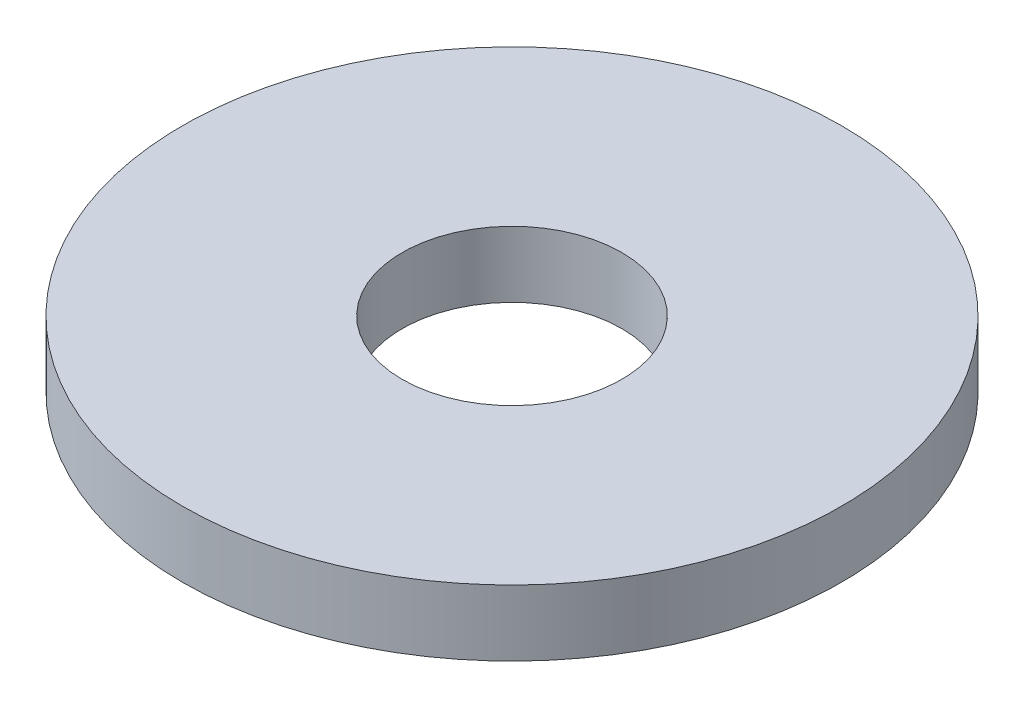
ISO-10303-21;
HEADER;
FILE_DESCRIPTION(('STEP AP214'),'2;1');
FILE_NAME('part.step','',(''),(''),'','','');
FILE_SCHEMA(('AUTOMOTIVE_DESIGN { 1 0 10303 214 1 1 1 1 }'));
ENDSEC;
DATA;
#1=APPLICATION_CONTEXT('core data for automotive mechanical design processes');
#2=APPLICATION_PROTOCOL_DEFINITION('international standard','automotive_design',2000,#1);
#3=PRODUCT_CONTEXT('',#1,'mechanical');
#4=PRODUCT('Part','Part','',(#3));
#5=PRODUCT_RELATED_PRODUCT_CATEGORY('part','',(#4));
#6=PRODUCT_DEFINITION_FORMATION('','',#4);
#7=PRODUCT_DEFINITION_CONTEXT('part definition',#1,'design');
#8=PRODUCT_DEFINITION('design','',#6,#7);
#9=PRODUCT_DEFINITION_SHAPE('','',#8);
#10=(LENGTH_UNIT() NAMED_UNIT(*) SI_UNIT(.MILLI.,.METRE.));
#11=(NAMED_UNIT(*) PLANE_ANGLE_UNIT() SI_UNIT($,.RADIAN.));
#12=(NAMED_UNIT(*) SI_UNIT($,.STERADIAN.) SOLID_ANGLE_UNIT());
#13=UNCERTAINTY_MEASURE_WITH_UNIT(LENGTH_MEASURE(1.E-05),#10,'distance_accuracy_value','');
#14=(GEOMETRIC_REPRESENTATION_CONTEXT(3) GLOBAL_UNCERTAINTY_ASSIGNED_CONTEXT((#13)) GLOBAL_UNIT_ASSIGNED_CONTEXT((#10,
#11,#12)) REPRESENTATION_CONTEXT('',''));
#15=CARTESIAN_POINT('',(0.,0.,0.));
#16=DIRECTION('',(0.,0.,1.));
#17=DIRECTION('',(1.,0.,0.));
#18=AXIS2_PLACEMENT_3D('',#15,#16,#17);
#19=CARTESIAN_POINT('',(0.,3.,0.));
#20=DIRECTION('',(0.,1.,0.));
#21=DIRECTION('',(0.,0.,1.));
#22=AXIS2_PLACEMENT_3D('',#19,#20,#21);
#23=PLANE('',#22);
#24=CARTESIAN_POINT('',(0.,3.,0.));
#25=DIRECTION('',(0.,1.,0.));
#26=DIRECTION('',(0.,0.,1.));
#27=AXIS2_PLACEMENT_3D('',#24,#25,#26);
#28=CIRCLE('',#27,15.);
#29=CARTESIAN_POINT('',(0.,3.,15.));
#30=VERTEX_POINT('',#29);
#31=EDGE_CURVE('E10',#30,#30,#28,.T.);
#32=ORIENTED_EDGE('',*,*,#31,.T.);
#33=EDGE_LOOP('',(#32));
#34=FACE_BOUND('',#33,.T.);
#35=CARTESIAN_POINT('',(0.,3.,0.));
#36=DIRECTION('',(0.,1.,0.));
#37=DIRECTION('',(0.,0.,1.));
#38=AXIS2_PLACEMENT_3D('',#35,#36,#37);
#39=CIRCLE('',#38,5.);
#40=CARTESIAN_POINT('',(0.,3.,5.));
#41=VERTEX_POINT('',#40);
#42=EDGE_CURVE('E40',#41,#41,#39,.T.);
#43=ORIENTED_EDGE('',*,*,#42,.F.);
#44=EDGE_LOOP('',(#43));
#45=FACE_BOUND('',#44,.T.);
#46=ADVANCED_FACE('F29',(#34,#45),#23,.T.);
#47=CARTESIAN_POINT('',(0.,0.,0.));
#48=DIRECTION('',(0.,1.,0.));
#49=DIRECTION('',(0.,0.,1.));
#50=AXIS2_PLACEMENT_3D('',#47,#48,#49);
#51=PLANE('',#50);
#52=CARTESIAN_POINT('',(0.,0.,0.));
#53=DIRECTION('',(0.,1.,0.));
#54=DIRECTION('',(0.,0.,1.));
#55=AXIS2_PLACEMENT_3D('',#52,#53,#54);
#56=CIRCLE('',#55,15.);
#57=CARTESIAN_POINT('',(0.,0.,15.));
#58=VERTEX_POINT('',#57);
#59=EDGE_CURVE('E36',#58,#58,#56,.T.);
#60=ORIENTED_EDGE('',*,*,#59,.F.);
#61=EDGE_LOOP('',(#60));
#62=FACE_BOUND('',#61,.T.);
#63=CARTESIAN_POINT('',(0.,0.,0.));
#64=DIRECTION('',(0.,1.,0.));
#65=DIRECTION('',(0.,0.,1.));
#66=AXIS2_PLACEMENT_3D('',#63,#64,#65);
#67=CIRCLE('',#66,5.);
#68=CARTESIAN_POINT('',(0.,0.,5.));
#69=VERTEX_POINT('',#68);
#70=EDGE_CURVE('E44',#69,#69,#67,.T.);
#71=ORIENTED_EDGE('',*,*,#70,.T.);
#72=EDGE_LOOP('',(#71));
#73=FACE_BOUND('',#72,.T.);
#74=ADVANCED_FACE('F50',(#62,#73),#51,.F.);
#75=CARTESIAN_POINT('',(0.,3.,0.));
#76=DIRECTION('',(0.,-1.,0.));
#77=DIRECTION('',(0.,0.,-1.));
#78=AXIS2_PLACEMENT_3D('',#75,#76,#77);
#79=CYLINDRICAL_SURFACE('',#78,15.);
#80=ORIENTED_EDGE('',*,*,#31,.F.);
#81=EDGE_LOOP('',(#80));
#82=FACE_BOUND('',#81,.T.);
#83=ORIENTED_EDGE('',*,*,#59,.T.);
#84=EDGE_LOOP('',(#83));
#85=FACE_BOUND('',#84,.T.);
#86=ADVANCED_FACE('F31',(#82,#85),#79,.T.);
#87=CARTESIAN_POINT('',(0.,3.,0.));
#88=DIRECTION('',(0.,-1.,0.));
#89=DIRECTION('',(0.,0.,-1.));
#90=AXIS2_PLACEMENT_3D('',#87,#88,#89);
#91=CYLINDRICAL_SURFACE('',#90,5.);
#92=ORIENTED_EDGE('',*,*,#42,.T.);
#93=EDGE_LOOP('',(#92));
#94=FACE_BOUND('',#93,.T.);
#95=ORIENTED_EDGE('',*,*,#70,.F.);
#96=EDGE_LOOP('',(#95));
#97=FACE_BOUND('',#96,.T.);
#98=ADVANCED_FACE('F52',(#94,#97),#91,.F.);
#99=CLOSED_SHELL('',(#46,#74,#86,#98));
#100=MANIFOLD_SOLID_BREP('B2',#99);
#101=ADVANCED_BREP_SHAPE_REPRESENTATION('',(#18,#100),#14);
#102=SHAPE_DEFINITION_REPRESENTATION(#9,#101);
ENDSEC;
END-ISO-10303-21;
